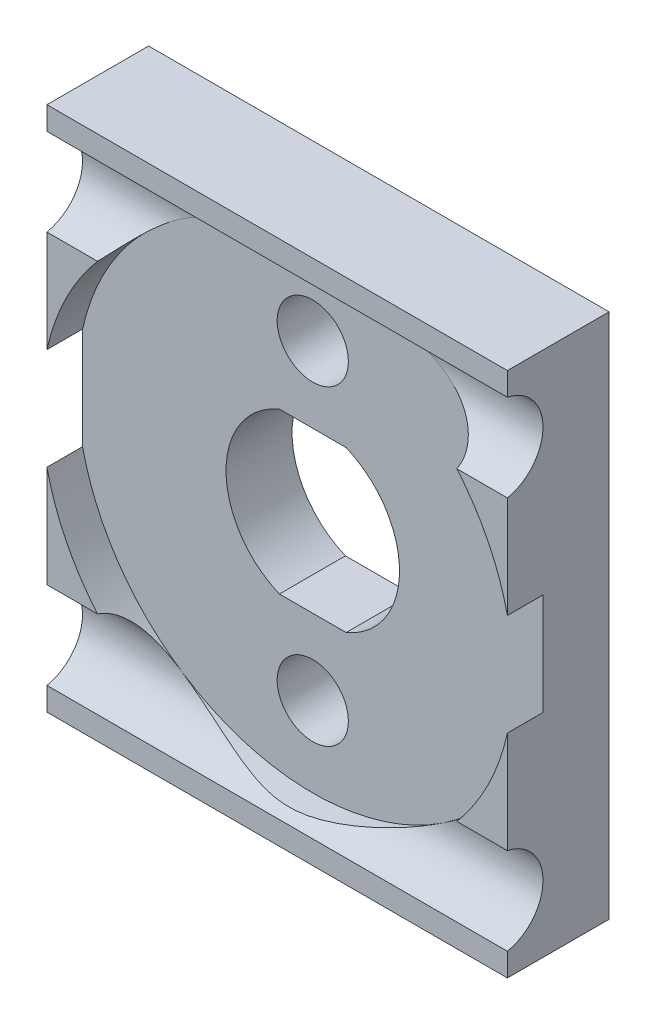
ISO-10303-21;
HEADER;
FILE_DESCRIPTION(('STEP AP214'),'2;1');
FILE_NAME('part.step','',(''),(''),'','','');
FILE_SCHEMA(('AUTOMOTIVE_DESIGN { 1 0 10303 214 1 1 1 1 }'));
ENDSEC;
DATA;
#1=APPLICATION_CONTEXT('core data for automotive mechanical design processes');
#2=APPLICATION_PROTOCOL_DEFINITION('international standard','automotive_design',2000,#1);
#3=PRODUCT_CONTEXT('',#1,'mechanical');
#4=PRODUCT('Part','Part','',(#3));
#5=PRODUCT_RELATED_PRODUCT_CATEGORY('part','',(#4));
#6=PRODUCT_DEFINITION_FORMATION('','',#4);
#7=PRODUCT_DEFINITION_CONTEXT('part definition',#1,'design');
#8=PRODUCT_DEFINITION('design','',#6,#7);
#9=PRODUCT_DEFINITION_SHAPE('','',#8);
#10=(LENGTH_UNIT() NAMED_UNIT(*) SI_UNIT(.MILLI.,.METRE.));
#11=(NAMED_UNIT(*) PLANE_ANGLE_UNIT() SI_UNIT($,.RADIAN.));
#12=(NAMED_UNIT(*) SI_UNIT($,.STERADIAN.) SOLID_ANGLE_UNIT());
#13=UNCERTAINTY_MEASURE_WITH_UNIT(LENGTH_MEASURE(1.E-05),#10,'distance_accuracy_value','');
#14=(GEOMETRIC_REPRESENTATION_CONTEXT(3) GLOBAL_UNCERTAINTY_ASSIGNED_CONTEXT((#13)) GLOBAL_UNIT_ASSIGNED_CONTEXT((#10,
#11,#12)) REPRESENTATION_CONTEXT('',''));
#15=CARTESIAN_POINT('',(0.,0.,0.));
#16=DIRECTION('',(0.,0.,1.));
#17=DIRECTION('',(1.,0.,0.));
#18=AXIS2_PLACEMENT_3D('',#15,#16,#17);
#19=CARTESIAN_POINT('',(-20.7,0.,4.57));
#20=DIRECTION('',(0.,0.,1.));
#21=DIRECTION('',(1.,0.,0.));
#22=AXIS2_PLACEMENT_3D('',#19,#20,#21);
#23=PLANE('',#22);
#24=DIRECTION('',(1.,0.,0.));
#25=VECTOR('',#24,1.);
#26=CARTESIAN_POINT('',(-20.7,18.6904082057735,4.57));
#27=LINE('',#26,#25);
#28=CARTESIAN_POINT('',(-20.7,18.6904082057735,4.57));
#29=VERTEX_POINT('',#28);
#30=CARTESIAN_POINT('',(-18.4262720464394,18.6904082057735,4.57));
#31=VERTEX_POINT('',#30);
#32=EDGE_CURVE('E46',#29,#31,#27,.T.);
#33=ORIENTED_EDGE('',*,*,#32,.F.);
#34=DIRECTION('',(0.,-1.,0.));
#35=VECTOR('',#34,1.);
#36=CARTESIAN_POINT('',(-20.7,23.65,4.57));
#37=LINE('',#36,#35);
#38=CARTESIAN_POINT('',(-20.7,14.1135584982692,4.57));
#39=VERTEX_POINT('',#38);
#40=EDGE_CURVE('E179',#29,#39,#37,.T.);
#41=ORIENTED_EDGE('',*,*,#40,.T.);
#42=CARTESIAN_POINT('',(-10.35,11.825,4.57));
#43=DIRECTION('',(0.,0.,1.));
#44=DIRECTION('',(1.,0.,0.));
#45=AXIS2_PLACEMENT_3D('',#42,#43,#44);
#46=CIRCLE('',#45,10.6);
#47=EDGE_CURVE('E181',#31,#39,#46,.T.);
#48=ORIENTED_EDGE('',*,*,#47,.F.);
#49=EDGE_LOOP('',(#33,#41,#48));
#50=FACE_BOUND('',#49,.T.);
#51=ADVANCED_FACE('F31',(#50),#23,.T.);
#52=CARTESIAN_POINT('',(-2.27372795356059,18.6904082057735,4.57));
#53=VERTEX_POINT('',#52);
#54=CARTESIAN_POINT('',(0.,18.6904082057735,4.57));
#55=VERTEX_POINT('',#54);
#56=EDGE_CURVE('E185',#53,#55,#27,.T.);
#57=ORIENTED_EDGE('',*,*,#56,.F.);
#58=CARTESIAN_POINT('',(0.,14.1135584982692,4.57));
#59=VERTEX_POINT('',#58);
#60=EDGE_CURVE('E284',#59,#53,#46,.T.);
#61=ORIENTED_EDGE('',*,*,#60,.F.);
#62=DIRECTION('',(0.,1.,0.));
#63=VECTOR('',#62,1.);
#64=CARTESIAN_POINT('',(0.,23.65,4.57));
#65=LINE('',#64,#63);
#66=EDGE_CURVE('E380',#59,#55,#65,.T.);
#67=ORIENTED_EDGE('',*,*,#66,.T.);
#68=EDGE_LOOP('',(#57,#61,#67));
#69=FACE_BOUND('',#68,.T.);
#70=ADVANCED_FACE('F323',(#69),#23,.T.);
#71=CARTESIAN_POINT('',(-10.35,11.825,2.97));
#72=DIRECTION('',(0.,0.,1.));
#73=DIRECTION('',(1.,0.,0.));
#74=AXIS2_PLACEMENT_3D('',#71,#72,#73);
#75=CYLINDRICAL_SURFACE('',#74,10.6);
#76=ORIENTED_EDGE('',*,*,#60,.T.);
#77=CARTESIAN_POINT('',(-2.27372795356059,18.6904082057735,4.57));
#78=CARTESIAN_POINT('',(-2.28220702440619,18.700379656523,4.5210976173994));
#79=CARTESIAN_POINT('',(-2.29223782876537,18.7121453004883,4.4728485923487));
#80=CARTESIAN_POINT('',(-2.31524815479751,18.7389775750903,4.37804860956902));
#81=CARTESIAN_POINT('',(-2.32822490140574,18.7540410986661,4.33149610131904));
#82=CARTESIAN_POINT('',(-2.35687266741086,18.7870675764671,4.24075534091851));
#83=CARTESIAN_POINT('',(-2.37252108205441,18.805006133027,4.19655103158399));
#84=CARTESIAN_POINT('',(-2.40641220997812,18.8435521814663,4.11036182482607));
#85=CARTESIAN_POINT('',(-2.4246554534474,18.864160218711,4.06837738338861));
#86=CARTESIAN_POINT('',(-2.48287698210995,18.9293467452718,3.94637174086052));
#87=CARTESIAN_POINT('',(-2.52647651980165,18.9774390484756,3.86989396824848));
#88=CARTESIAN_POINT('',(-2.62191541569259,19.0804576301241,3.72729442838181));
#89=CARTESIAN_POINT('',(-2.67377295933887,19.1353989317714,3.66119617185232));
#90=CARTESIAN_POINT('',(-2.80915188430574,19.2754220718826,3.51221071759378));
#91=CARTESIAN_POINT('',(-2.89644963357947,19.3629786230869,3.43507116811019));
#92=CARTESIAN_POINT('',(-3.08193633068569,19.5419904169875,3.30120804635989));
#93=CARTESIAN_POINT('',(-3.18014325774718,19.6334519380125,3.24451885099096));
#94=CARTESIAN_POINT('',(-3.35744848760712,19.7920827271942,3.1617667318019));
#95=CARTESIAN_POINT('',(-3.43468679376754,19.8592465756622,3.13156840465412));
#96=CARTESIAN_POINT('',(-3.5927757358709,19.9926582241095,3.07975618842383));
#97=CARTESIAN_POINT('',(-3.67362806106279,20.0589055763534,3.05814636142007));
#98=CARTESIAN_POINT('',(-3.92081362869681,20.2552858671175,3.00463333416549));
#99=CARTESIAN_POINT('',(-4.09163864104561,20.3829339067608,2.98410564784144));
#100=CARTESIAN_POINT('',(-4.40929989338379,20.6055876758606,2.96797648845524));
#101=CARTESIAN_POINT('',(-4.55483064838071,20.7023013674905,2.96851245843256));
#102=CARTESIAN_POINT('',(-4.85015823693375,20.8882316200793,2.98205267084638));
#103=CARTESIAN_POINT('',(-4.99995787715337,20.9774430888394,2.99506530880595));
#104=CARTESIAN_POINT('',(-5.30320420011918,21.1481018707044,3.03105227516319));
#105=CARTESIAN_POINT('',(-5.45665932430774,21.2295284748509,3.05405231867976));
#106=CARTESIAN_POINT('',(-5.76628708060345,21.3842647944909,3.10785990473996));
#107=CARTESIAN_POINT('',(-5.92246061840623,21.4575717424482,3.13867009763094));
#108=CARTESIAN_POINT('',(-6.35068554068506,21.6460535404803,3.23061263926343));
#109=CARTESIAN_POINT('',(-6.6250274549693,21.7532651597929,3.29758156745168));
#110=CARTESIAN_POINT('',(-7.04094692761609,21.8963315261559,3.40468364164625));
#111=CARTESIAN_POINT('',(-7.18044391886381,21.9410928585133,3.44152724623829));
#112=CARTESIAN_POINT('',(-7.46090308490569,22.0247316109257,3.5162957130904));
#113=CARTESIAN_POINT('',(-7.60186507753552,22.0636097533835,3.55422044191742));
#114=CARTESIAN_POINT('',(-7.88435376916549,22.1352706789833,3.62960605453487));
#115=CARTESIAN_POINT('',(-8.0258700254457,22.1680933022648,3.66706833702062));
#116=CARTESIAN_POINT('',(-8.31058738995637,22.2279785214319,3.74027707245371));
#117=CARTESIAN_POINT('',(-8.45378874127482,22.2550402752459,3.77602327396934));
#118=CARTESIAN_POINT('',(-8.74180501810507,22.3033106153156,3.84381520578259));
#119=CARTESIAN_POINT('',(-8.88661687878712,22.3245288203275,3.87586696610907));
#120=CARTESIAN_POINT('',(-9.17815744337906,22.361050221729,3.93390897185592));
#121=CARTESIAN_POINT('',(-9.32488528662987,22.3763559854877,3.95990184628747));
#122=CARTESIAN_POINT('',(-9.62948314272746,22.4016551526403,4.00438499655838));
#123=CARTESIAN_POINT('',(-9.78747421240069,22.4112545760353,4.0223015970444));
#124=CARTESIAN_POINT('',(-10.1046153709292,22.4233455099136,4.04510602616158));
#125=CARTESIAN_POINT('',(-10.2637645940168,22.4258418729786,4.05000274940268));
#126=CARTESIAN_POINT('',(-10.5819111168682,22.4236576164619,4.04580274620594));
#127=CARTESIAN_POINT('',(-10.7409082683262,22.4189726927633,4.03669762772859));
#128=CARTESIAN_POINT('',(-11.0574185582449,22.4025572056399,4.00624487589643));
#129=CARTESIAN_POINT('',(-11.2149303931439,22.3908209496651,3.9848873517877));
#130=CARTESIAN_POINT('',(-11.5043068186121,22.3628098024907,3.93707968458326));
#131=CARTESIAN_POINT('',(-11.6364789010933,22.3474781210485,3.91187162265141));
#132=CARTESIAN_POINT('',(-11.8992616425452,22.3120096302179,3.85698995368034));
#133=CARTESIAN_POINT('',(-12.0298718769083,22.291871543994,3.82731516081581));
#134=CARTESIAN_POINT('',(-12.2897079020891,22.246848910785,3.76519898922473));
#135=CARTESIAN_POINT('',(-12.4189325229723,22.2219606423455,3.73275545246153));
#136=CARTESIAN_POINT('',(-12.6760367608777,22.1674763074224,3.6665006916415));
#137=CARTESIAN_POINT('',(-12.803916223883,22.1378797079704,3.63268931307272));
#138=CARTESIAN_POINT('',(-13.1867016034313,22.0417792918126,3.53066883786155));
#139=CARTESIAN_POINT('',(-13.4397633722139,21.9681368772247,3.46212925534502));
#140=CARTESIAN_POINT('',(-13.9409912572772,21.8016920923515,3.33145297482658));
#141=CARTESIAN_POINT('',(-14.189161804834,21.7089080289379,3.26931024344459));
#142=CARTESIAN_POINT('',(-14.5764438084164,21.5471792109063,3.18125433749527));
#143=CARTESIAN_POINT('',(-14.7173241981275,21.4847295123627,3.15112842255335));
#144=CARTESIAN_POINT('',(-14.9970844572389,21.3532989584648,3.09638347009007));
#145=CARTESIAN_POINT('',(-15.1359647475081,21.2843195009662,3.07176325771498));
#146=CARTESIAN_POINT('',(-15.4112727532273,21.1399158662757,3.02947459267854));
#147=CARTESIAN_POINT('',(-15.5477025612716,21.0644975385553,3.01179991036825));
#148=CARTESIAN_POINT('',(-15.8177185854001,20.9073143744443,2.98502005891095));
#149=CARTESIAN_POINT('',(-15.9513056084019,20.8255513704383,2.97591242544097));
#150=CARTESIAN_POINT('',(-16.1814691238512,20.6775503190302,2.96918882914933));
#151=CARTESIAN_POINT('',(-16.2788316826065,20.6126406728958,2.96924243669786));
#152=CARTESIAN_POINT('',(-16.4711820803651,20.4797550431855,2.9761486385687));
#153=CARTESIAN_POINT('',(-16.5661705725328,20.4117799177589,2.98299934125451));
#154=CARTESIAN_POINT('',(-16.7531579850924,20.2732588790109,3.00455550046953));
#155=CARTESIAN_POINT('',(-16.8451611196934,20.2027169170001,3.01924932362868));
#156=CARTESIAN_POINT('',(-17.0256173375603,20.059645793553,3.05768080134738));
#157=CARTESIAN_POINT('',(-17.114072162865,19.9871176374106,3.08141395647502));
#158=CARTESIAN_POINT('',(-17.3120303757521,19.8194657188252,3.14775797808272));
#159=CARTESIAN_POINT('',(-17.4200873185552,19.7239607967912,3.19386574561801));
#160=CARTESIAN_POINT('',(-17.6264181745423,19.5342992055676,3.30646888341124));
#161=CARTESIAN_POINT('',(-17.7247035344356,19.4401410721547,3.37294001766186));
#162=CARTESIAN_POINT('',(-17.8881493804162,19.2779570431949,3.51182419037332));
#163=CARTESIAN_POINT('',(-17.9558595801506,19.2087100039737,3.57978078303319));
#164=CARTESIAN_POINT('',(-18.0812427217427,19.0773172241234,3.73039637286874));
#165=CARTESIAN_POINT('',(-18.1389241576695,19.0151654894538,3.81304280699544));
#166=CARTESIAN_POINT('',(-18.2326130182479,18.9121977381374,3.97621698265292));
#167=CARTESIAN_POINT('',(-18.2706536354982,18.8695559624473,4.0544241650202));
#168=CARTESIAN_POINT('',(-18.3371230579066,18.7941031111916,4.21913505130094));
#169=CARTESIAN_POINT('',(-18.3655753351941,18.761268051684,4.30561781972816));
#170=CARTESIAN_POINT('',(-18.3960440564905,18.7258188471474,4.42371723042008));
#171=CARTESIAN_POINT('',(-18.4028704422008,18.7178492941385,4.45260158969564));
#172=CARTESIAN_POINT('',(-18.4154094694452,18.703172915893,4.51090913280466));
#173=CARTESIAN_POINT('',(-18.4211227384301,18.6964653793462,4.5403320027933));
#174=CARTESIAN_POINT('',(-18.4262720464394,18.6904082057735,4.57));
#175=B_SPLINE_CURVE_WITH_KNOTS('',3,(#77,#78,#79,#80,#81,#82,#83,#84,#85,#86,#87,#88,#89,#90,
#91,#92,#93,#94,#95,#96,#97,#98,#99,#100,#101,#102,#103,#104,#105,#106,#107,#108,#109,#110,#111,
#112,#113,#114,#115,#116,#117,#118,#119,#120,#121,#122,#123,#124,#125,#126,#127,#128,#129,#130,
#131,#132,#133,#134,#135,#136,#137,#138,#139,#140,#141,#142,#143,#144,#145,#146,#147,#148,#149,
#150,#151,#152,#153,#154,#155,#156,#157,#158,#159,#160,#161,#162,#163,#164,#165,#166,#167,#168,
#169,#170,#171,#172,#173,#174),.UNSPECIFIED.,.F.,.F.,(4,2,2,2,2,2,2,2,2,2,2,2,2,2,2,2,2,2,2,2,2,
2,2,2,2,2,2,2,2,2,2,2,2,2,2,2,2,2,2,2,2,2,2,2,2,2,2,2,4),(0.,0.151785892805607,0.3034293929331,
0.453848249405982,0.604297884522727,0.903862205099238,1.20409557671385,1.6388540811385,
2.07434004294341,2.39406350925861,2.71393801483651,3.35426011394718,3.87782539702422,
4.4017432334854,4.92701810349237,5.45247146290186,6.35712237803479,6.81023339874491,
7.2632887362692,7.71324787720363,8.16327274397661,8.61255235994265,9.06163666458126,
9.53892348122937,10.0158841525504,10.493130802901,10.9707632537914,11.3768487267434,
11.7830421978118,12.1895552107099,12.5961142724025,13.4123389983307,14.2277866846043,
14.6986385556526,15.1693898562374,15.6397179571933,16.1099107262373,16.4607338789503,
16.8114594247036,17.1616661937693,17.5116988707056,17.9645171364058,18.4167985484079,
18.7704549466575,19.1238103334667,19.4132533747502,19.7019826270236,19.7941387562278,
19.8862427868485),.UNSPECIFIED.);
#176=CARTESIAN_POINT('',(-4.47808591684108,20.65,2.97));
#177=VERTEX_POINT('',#176);
#178=EDGE_CURVE('E182',#53,#177,#175,.T.);
#179=ORIENTED_EDGE('',*,*,#178,.T.);
#180=CARTESIAN_POINT('',(-10.35,11.825,2.97));
#181=DIRECTION('',(0.,0.,1.));
#182=DIRECTION('',(1.,0.,0.));
#183=AXIS2_PLACEMENT_3D('',#180,#181,#182);
#184=CIRCLE('',#183,10.6);
#185=CARTESIAN_POINT('',(0.,14.1135584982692,2.97));
#186=VERTEX_POINT('',#185);
#187=EDGE_CURVE('E258',#186,#177,#184,.T.);
#188=ORIENTED_EDGE('',*,*,#187,.F.);
#189=DIRECTION('',(0.,0.,1.));
#190=VECTOR('',#189,1.);
#191=CARTESIAN_POINT('',(0.,14.1135584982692,2.97));
#192=LINE('',#191,#190);
#193=EDGE_CURVE('E247',#186,#59,#192,.T.);
#194=ORIENTED_EDGE('',*,*,#193,.T.);
#195=EDGE_LOOP('',(#76,#179,#188,#194));
#196=FACE_BOUND('',#195,.T.);
#197=ADVANCED_FACE('F329',(#196),#75,.F.);
#198=CARTESIAN_POINT('',(-16.2219140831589,20.65,2.97));
#199=VERTEX_POINT('',#198);
#200=EDGE_CURVE('E261',#177,#199,#184,.T.);
#201=ORIENTED_EDGE('',*,*,#200,.F.);
#202=EDGE_CURVE('E183',#177,#199,#175,.T.);
#203=ORIENTED_EDGE('',*,*,#202,.T.);
#204=EDGE_LOOP('',(#201,#203));
#205=FACE_BOUND('',#204,.T.);
#206=ADVANCED_FACE('F366',(#205),#75,.F.);
#207=DIRECTION('',(1.,0.,0.));
#208=VECTOR('',#207,1.);
#209=CARTESIAN_POINT('',(-20.7,1.04040820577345,4.57));
#210=LINE('',#209,#208);
#211=CARTESIAN_POINT('',(-20.7,1.04040820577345,4.57));
#212=VERTEX_POINT('',#211);
#213=CARTESIAN_POINT('',(0.,1.04040820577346,4.57));
#214=VERTEX_POINT('',#213);
#215=EDGE_CURVE('E288',#212,#214,#210,.T.);
#216=ORIENTED_EDGE('',*,*,#215,.F.);
#217=CARTESIAN_POINT('',(-20.7,0.,4.57));
#218=VERTEX_POINT('',#217);
#219=EDGE_CURVE('E193',#212,#218,#37,.T.);
#220=ORIENTED_EDGE('',*,*,#219,.T.);
#221=DIRECTION('',(1.,0.,0.));
#222=VECTOR('',#221,1.);
#223=CARTESIAN_POINT('',(-20.7,0.,4.57));
#224=LINE('',#223,#222);
#225=CARTESIAN_POINT('',(0.,0.,4.57));
#226=VERTEX_POINT('',#225);
#227=EDGE_CURVE('E194',#218,#226,#224,.T.);
#228=ORIENTED_EDGE('',*,*,#227,.T.);
#229=EDGE_CURVE('E379',#226,#214,#65,.T.);
#230=ORIENTED_EDGE('',*,*,#229,.T.);
#231=EDGE_LOOP('',(#216,#220,#228,#230));
#232=FACE_BOUND('',#231,.T.);
#233=ADVANCED_FACE('F331',(#232),#23,.T.);
#234=DIRECTION('',(1.,0.,0.));
#235=VECTOR('',#234,1.);
#236=CARTESIAN_POINT('',(-20.7,4.95959179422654,4.57));
#237=LINE('',#236,#235);
#238=CARTESIAN_POINT('',(0.,4.95959179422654,4.57));
#239=VERTEX_POINT('',#238);
#240=CARTESIAN_POINT('',(-2.27372795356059,4.95959179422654,4.57));
#241=VERTEX_POINT('',#240);
#242=EDGE_CURVE('E54',#239,#241,#237,.F.);
#243=ORIENTED_EDGE('',*,*,#242,.F.);
#244=CARTESIAN_POINT('',(0.,9.53644150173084,4.57));
#245=VERTEX_POINT('',#244);
#246=EDGE_CURVE('E369',#239,#245,#65,.T.);
#247=ORIENTED_EDGE('',*,*,#246,.T.);
#248=EDGE_CURVE('E287',#241,#245,#46,.T.);
#249=ORIENTED_EDGE('',*,*,#248,.F.);
#250=EDGE_LOOP('',(#243,#247,#249));
#251=FACE_BOUND('',#250,.T.);
#252=ADVANCED_FACE('F348',(#251),#23,.T.);
#253=CARTESIAN_POINT('',(-20.7,9.53644150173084,4.57));
#254=VERTEX_POINT('',#253);
#255=CARTESIAN_POINT('',(-18.4262720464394,4.95959179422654,4.57));
#256=VERTEX_POINT('',#255);
#257=EDGE_CURVE('E283',#254,#256,#46,.T.);
#258=ORIENTED_EDGE('',*,*,#257,.T.);
#259=CARTESIAN_POINT('',(-18.4262720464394,4.95959179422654,4.57));
#260=CARTESIAN_POINT('',(-18.4177929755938,4.94962034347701,4.5210976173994));
#261=CARTESIAN_POINT('',(-18.4077621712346,4.93785469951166,4.4728485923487));
#262=CARTESIAN_POINT('',(-18.3847518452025,4.91102242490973,4.37804860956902));
#263=CARTESIAN_POINT('',(-18.3717750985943,4.89595890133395,4.33149610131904));
#264=CARTESIAN_POINT('',(-18.3431273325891,4.86293242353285,4.24075534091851));
#265=CARTESIAN_POINT('',(-18.3274789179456,4.84499386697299,4.19655103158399));
#266=CARTESIAN_POINT('',(-18.2935877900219,4.80644781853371,4.11036182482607));
#267=CARTESIAN_POINT('',(-18.2753445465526,4.78583978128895,4.06837738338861));
#268=CARTESIAN_POINT('',(-18.21712301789,4.72065325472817,3.94637174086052));
#269=CARTESIAN_POINT('',(-18.1735234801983,4.67256095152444,3.86989396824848));
#270=CARTESIAN_POINT('',(-18.0780845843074,4.5695423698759,3.72729442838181));
#271=CARTESIAN_POINT('',(-18.0262270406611,4.51460106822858,3.66119617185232));
#272=CARTESIAN_POINT('',(-17.8908481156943,4.37457792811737,3.51221071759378));
#273=CARTESIAN_POINT('',(-17.8035503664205,4.28702137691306,3.43507116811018));
#274=CARTESIAN_POINT('',(-17.6180636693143,4.10800958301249,3.30120804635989));
#275=CARTESIAN_POINT('',(-17.5198567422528,4.01654806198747,3.24451885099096));
#276=CARTESIAN_POINT('',(-17.3425515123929,3.85791727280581,3.1617667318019));
#277=CARTESIAN_POINT('',(-17.2653132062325,3.79075342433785,3.13156840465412));
#278=CARTESIAN_POINT('',(-17.1072242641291,3.65734177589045,3.07975618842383));
#279=CARTESIAN_POINT('',(-17.0263719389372,3.59109442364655,3.05814636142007));
#280=CARTESIAN_POINT('',(-16.7791863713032,3.3947141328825,3.00463333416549));
#281=CARTESIAN_POINT('',(-16.6083613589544,3.26706609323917,2.98410564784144));
#282=CARTESIAN_POINT('',(-16.2907001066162,3.04441232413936,2.96797648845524));
#283=CARTESIAN_POINT('',(-16.1451693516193,2.9476986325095,2.96851245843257));
#284=CARTESIAN_POINT('',(-15.8498417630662,2.76176837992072,2.98205267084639));
#285=CARTESIAN_POINT('',(-15.7000421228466,2.67255691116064,2.99506530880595));
#286=CARTESIAN_POINT('',(-15.3967957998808,2.50189812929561,3.03105227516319));
#287=CARTESIAN_POINT('',(-15.2433406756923,2.42047152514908,3.05405231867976));
#288=CARTESIAN_POINT('',(-14.9337129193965,2.26573520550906,3.10785990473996));
#289=CARTESIAN_POINT('',(-14.7775393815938,2.19242825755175,3.13867009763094));
#290=CARTESIAN_POINT('',(-14.3493144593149,2.00394645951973,3.23061263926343));
#291=CARTESIAN_POINT('',(-14.0749725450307,1.8967348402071,3.29758156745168));
#292=CARTESIAN_POINT('',(-13.6590530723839,1.75366847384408,3.40468364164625));
#293=CARTESIAN_POINT('',(-13.5195560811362,1.70890714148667,3.44152724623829));
#294=CARTESIAN_POINT('',(-13.2390969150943,1.62526838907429,3.5162957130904));
#295=CARTESIAN_POINT('',(-13.0981349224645,1.58639024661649,3.55422044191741));
#296=CARTESIAN_POINT('',(-12.8156462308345,1.51472932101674,3.62960605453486));
#297=CARTESIAN_POINT('',(-12.6741299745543,1.48190669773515,3.66706833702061));
#298=CARTESIAN_POINT('',(-12.3894126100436,1.42202147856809,3.74027707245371));
#299=CARTESIAN_POINT('',(-12.2462112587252,1.39495972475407,3.77602327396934));
#300=CARTESIAN_POINT('',(-11.9581949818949,1.34668938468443,3.84381520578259));
#301=CARTESIAN_POINT('',(-11.8133831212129,1.32547117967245,3.87586696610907));
#302=CARTESIAN_POINT('',(-11.5218425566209,1.28894977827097,3.93390897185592));
#303=CARTESIAN_POINT('',(-11.3751147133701,1.27364401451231,3.95990184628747));
#304=CARTESIAN_POINT('',(-11.0705168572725,1.24834484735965,4.00438499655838));
#305=CARTESIAN_POINT('',(-10.9125257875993,1.23874542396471,4.0223015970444));
#306=CARTESIAN_POINT('',(-10.5953846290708,1.22665449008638,4.04510602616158));
#307=CARTESIAN_POINT('',(-10.4362354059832,1.22415812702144,4.05000274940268));
#308=CARTESIAN_POINT('',(-10.1180888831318,1.22634238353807,4.04580274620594));
#309=CARTESIAN_POINT('',(-9.95909173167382,1.23102730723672,4.03669762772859));
#310=CARTESIAN_POINT('',(-9.64258144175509,1.24744279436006,4.00624487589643));
#311=CARTESIAN_POINT('',(-9.48506960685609,1.25917905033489,3.9848873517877));
#312=CARTESIAN_POINT('',(-9.1956931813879,1.28719019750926,3.93707968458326));
#313=CARTESIAN_POINT('',(-9.06352109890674,1.30252187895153,3.9118716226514));
#314=CARTESIAN_POINT('',(-8.80073835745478,1.33799036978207,3.85698995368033));
#315=CARTESIAN_POINT('',(-8.67012812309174,1.35812845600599,3.8273151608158));
#316=CARTESIAN_POINT('',(-8.41029209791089,1.40315108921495,3.76519898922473));
#317=CARTESIAN_POINT('',(-8.28106747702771,1.42803935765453,3.73275545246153));
#318=CARTESIAN_POINT('',(-8.02396323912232,1.48252369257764,3.6665006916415));
#319=CARTESIAN_POINT('',(-7.89608377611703,1.51212029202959,3.63268931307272));
#320=CARTESIAN_POINT('',(-7.51329839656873,1.60822070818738,3.53066883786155));
#321=CARTESIAN_POINT('',(-7.26023662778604,1.68186312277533,3.46212925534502));
#322=CARTESIAN_POINT('',(-6.75900874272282,1.8483079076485,3.33145297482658));
#323=CARTESIAN_POINT('',(-6.51083819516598,1.94109197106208,3.26931024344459));
#324=CARTESIAN_POINT('',(-6.12355619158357,2.10282078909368,3.18125433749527));
#325=CARTESIAN_POINT('',(-5.98267580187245,2.16527048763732,3.15112842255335));
#326=CARTESIAN_POINT('',(-5.70291554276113,2.29670104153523,3.09638347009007));
#327=CARTESIAN_POINT('',(-5.56403525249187,2.36568049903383,3.07176325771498));
#328=CARTESIAN_POINT('',(-5.28872724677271,2.5100841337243,3.02947459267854));
#329=CARTESIAN_POINT('',(-5.15229743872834,2.5855024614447,3.01179991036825));
#330=CARTESIAN_POINT('',(-4.88228141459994,2.7426856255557,2.98502005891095));
#331=CARTESIAN_POINT('',(-4.74869439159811,2.8244486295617,2.97591242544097));
#332=CARTESIAN_POINT('',(-4.51853087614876,2.97244968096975,2.96918882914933));
#333=CARTESIAN_POINT('',(-4.4211683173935,3.03735932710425,2.96924243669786));
#334=CARTESIAN_POINT('',(-4.22881791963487,3.17024495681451,2.9761486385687));
#335=CARTESIAN_POINT('',(-4.13382942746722,3.23822008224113,2.98299934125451));
#336=CARTESIAN_POINT('',(-3.94684201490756,3.37674112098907,3.00455550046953));
#337=CARTESIAN_POINT('',(-3.85483888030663,3.44728308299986,3.01924932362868));
#338=CARTESIAN_POINT('',(-3.67438266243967,3.59035420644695,3.05768080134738));
#339=CARTESIAN_POINT('',(-3.58592783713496,3.66288236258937,3.08141395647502));
#340=CARTESIAN_POINT('',(-3.3879696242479,3.83053428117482,3.14775797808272));
#341=CARTESIAN_POINT('',(-3.27991268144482,3.92603920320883,3.19386574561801));
#342=CARTESIAN_POINT('',(-3.0735818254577,4.11570079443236,3.30646888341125));
#343=CARTESIAN_POINT('',(-2.97529646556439,4.20985892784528,3.37294001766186));
#344=CARTESIAN_POINT('',(-2.81185061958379,4.37204295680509,3.51182419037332));
#345=CARTESIAN_POINT('',(-2.74414041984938,4.44128999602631,3.57978078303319));
#346=CARTESIAN_POINT('',(-2.61875727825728,4.57268277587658,3.73039637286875));
#347=CARTESIAN_POINT('',(-2.56107584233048,4.63483451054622,3.81304280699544));
#348=CARTESIAN_POINT('',(-2.46738698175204,4.73780226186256,3.97621698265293));
#349=CARTESIAN_POINT('',(-2.42934636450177,4.78044403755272,4.05442416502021));
#350=CARTESIAN_POINT('',(-2.36287694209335,4.85589688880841,4.21913505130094));
#351=CARTESIAN_POINT('',(-2.33442466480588,4.88873194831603,4.30561781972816));
#352=CARTESIAN_POINT('',(-2.3039559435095,4.92418115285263,4.42371723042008));
#353=CARTESIAN_POINT('',(-2.29712955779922,4.93215070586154,4.45260158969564));
#354=CARTESIAN_POINT('',(-2.28459053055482,4.946827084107,4.51090913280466));
#355=CARTESIAN_POINT('',(-2.2788772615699,4.95353462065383,4.5403320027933));
#356=CARTESIAN_POINT('',(-2.2737279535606,4.95959179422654,4.57));
#357=B_SPLINE_CURVE_WITH_KNOTS('',3,(#259,#260,#261,#262,#263,#264,#265,#266,#267,#268,#269,
#270,#271,#272,#273,#274,#275,#276,#277,#278,#279,#280,#281,#282,#283,#284,#285,#286,#287,#288,
#289,#290,#291,#292,#293,#294,#295,#296,#297,#298,#299,#300,#301,#302,#303,#304,#305,#306,#307,
#308,#309,#310,#311,#312,#313,#314,#315,#316,#317,#318,#319,#320,#321,#322,#323,#324,#325,#326,
#327,#328,#329,#330,#331,#332,#333,#334,#335,#336,#337,#338,#339,#340,#341,#342,#343,#344,#345,
#346,#347,#348,#349,#350,#351,#352,#353,#354,#355,#356),.UNSPECIFIED.,.F.,.F.,(4,2,2,2,2,2,2,2,
2,2,2,2,2,2,2,2,2,2,2,2,2,2,2,2,2,2,2,2,2,2,2,2,2,2,2,2,2,2,2,2,2,2,2,2,2,2,2,2,4),(0.,
0.151785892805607,0.303429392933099,0.453848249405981,0.604297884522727,0.90386220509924,
1.20409557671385,1.6388540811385,2.07434004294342,2.39406350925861,2.71393801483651,
3.35426011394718,3.87782539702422,4.4017432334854,4.92701810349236,5.45247146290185,
6.35712237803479,6.81023339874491,7.2632887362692,7.71324787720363,8.16327274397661,
8.61255235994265,9.06163666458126,9.53892348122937,10.0158841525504,10.493130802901,
10.9707632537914,11.3768487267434,11.7830421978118,12.1895552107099,12.5961142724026,
13.4123389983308,14.2277866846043,14.6986385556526,15.1693898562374,15.6397179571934,
16.1099107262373,16.4607338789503,16.8114594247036,17.1616661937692,17.5116988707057,
17.9645171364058,18.4167985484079,18.7704549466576,19.1238103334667,19.4132533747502,
19.7019826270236,19.7941387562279,19.8862427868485),.UNSPECIFIED.);
#358=CARTESIAN_POINT('',(-16.2219140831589,3.,2.97));
#359=VERTEX_POINT('',#358);
#360=EDGE_CURVE('E292',#256,#359,#357,.T.);
#361=ORIENTED_EDGE('',*,*,#360,.T.);
#362=CARTESIAN_POINT('',(-20.7,9.53644150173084,2.97));
#363=VERTEX_POINT('',#362);
#364=EDGE_CURVE('E249',#363,#359,#184,.T.);
#365=ORIENTED_EDGE('',*,*,#364,.F.);
#366=DIRECTION('',(0.,0.,1.));
#367=VECTOR('',#366,1.);
#368=CARTESIAN_POINT('',(-20.7,9.53644150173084,2.97));
#369=LINE('',#368,#367);
#370=EDGE_CURVE('E251',#363,#254,#369,.T.);
#371=ORIENTED_EDGE('',*,*,#370,.T.);
#372=EDGE_LOOP('',(#258,#361,#365,#371));
#373=FACE_BOUND('',#372,.T.);
#374=ADVANCED_FACE('F356',(#373),#75,.F.);
#375=CARTESIAN_POINT('',(-4.47808591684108,3.,2.97));
#376=VERTEX_POINT('',#375);
#377=EDGE_CURVE('E428',#359,#376,#184,.T.);
#378=ORIENTED_EDGE('',*,*,#377,.F.);
#379=EDGE_CURVE('E293',#359,#376,#357,.T.);
#380=ORIENTED_EDGE('',*,*,#379,.T.);
#381=EDGE_LOOP('',(#378,#380));
#382=FACE_BOUND('',#381,.T.);
#383=ADVANCED_FACE('F320',(#382),#75,.F.);
#384=CARTESIAN_POINT('',(-20.7,4.95959179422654,4.57));
#385=VERTEX_POINT('',#384);
#386=EDGE_CURVE('E290',#256,#385,#237,.F.);
#387=ORIENTED_EDGE('',*,*,#386,.F.);
#388=ORIENTED_EDGE('',*,*,#257,.F.);
#389=EDGE_CURVE('E191',#254,#385,#37,.T.);
#390=ORIENTED_EDGE('',*,*,#389,.T.);
#391=EDGE_LOOP('',(#387,#388,#390));
#392=FACE_BOUND('',#391,.T.);
#393=ADVANCED_FACE('F338',(#392),#23,.T.);
#394=CARTESIAN_POINT('',(-10.35,8.225,0.));
#395=DIRECTION('',(0.,-1.,0.));
#396=DIRECTION('',(0.,0.,-1.));
#397=AXIS2_PLACEMENT_3D('',#394,#395,#396);
#398=PLANE('',#397);
#399=DIRECTION('',(1.,0.,0.));
#400=VECTOR('',#399,1.);
#401=CARTESIAN_POINT('',(-10.35,8.225,2.97));
#402=LINE('',#401,#400);
#403=CARTESIAN_POINT('',(-11.85,8.225,2.97));
#404=VERTEX_POINT('',#403);
#405=CARTESIAN_POINT('',(-8.85,8.225,2.97));
#406=VERTEX_POINT('',#405);
#407=EDGE_CURVE('E274',#404,#406,#402,.T.);
#408=ORIENTED_EDGE('',*,*,#407,.T.);
#409=DIRECTION('',(0.,0.,1.));
#410=VECTOR('',#409,1.);
#411=CARTESIAN_POINT('',(-8.85,8.225,0.));
#412=LINE('',#411,#410);
#413=CARTESIAN_POINT('',(-8.85,8.225,0.));
#414=VERTEX_POINT('',#413);
#415=EDGE_CURVE('E217',#414,#406,#412,.T.);
#416=ORIENTED_EDGE('',*,*,#415,.F.);
#417=DIRECTION('',(1.,0.,0.));
#418=VECTOR('',#417,1.);
#419=CARTESIAN_POINT('',(-10.35,8.225,0.));
#420=LINE('',#419,#418);
#421=CARTESIAN_POINT('',(-11.85,8.225,0.));
#422=VERTEX_POINT('',#421);
#423=EDGE_CURVE('E237',#422,#414,#420,.T.);
#424=ORIENTED_EDGE('',*,*,#423,.F.);
#425=DIRECTION('',(0.,0.,1.));
#426=VECTOR('',#425,1.);
#427=CARTESIAN_POINT('',(-11.85,8.225,0.));
#428=LINE('',#427,#426);
#429=EDGE_CURVE('E216',#422,#404,#428,.T.);
#430=ORIENTED_EDGE('',*,*,#429,.T.);
#431=EDGE_LOOP('',(#408,#416,#424,#430));
#432=FACE_BOUND('',#431,.T.);
#433=ADVANCED_FACE('F346',(#432),#398,.F.);
#434=CARTESIAN_POINT('',(-10.35,11.825,0.));
#435=DIRECTION('',(0.,0.,1.));
#436=DIRECTION('',(1.,0.,0.));
#437=AXIS2_PLACEMENT_3D('',#434,#435,#436);
#438=CYLINDRICAL_SURFACE('',#437,3.9);
#439=CARTESIAN_POINT('',(-10.35,11.825,2.97));
#440=DIRECTION('',(0.,0.,1.));
#441=DIRECTION('',(1.,0.,0.));
#442=AXIS2_PLACEMENT_3D('',#439,#440,#441);
#443=CIRCLE('',#442,3.9);
#444=CARTESIAN_POINT('',(-11.85,15.425,2.97));
#445=VERTEX_POINT('',#444);
#446=EDGE_CURVE('E271',#445,#404,#443,.T.);
#447=ORIENTED_EDGE('',*,*,#446,.T.);
#448=ORIENTED_EDGE('',*,*,#429,.F.);
#449=CARTESIAN_POINT('',(-10.35,11.825,0.));
#450=DIRECTION('',(0.,0.,1.));
#451=DIRECTION('',(1.,0.,0.));
#452=AXIS2_PLACEMENT_3D('',#449,#450,#451);
#453=CIRCLE('',#452,3.9);
#454=CARTESIAN_POINT('',(-11.85,15.425,0.));
#455=VERTEX_POINT('',#454);
#456=EDGE_CURVE('E221',#455,#422,#453,.T.);
#457=ORIENTED_EDGE('',*,*,#456,.F.);
#458=DIRECTION('',(0.,0.,1.));
#459=VECTOR('',#458,1.);
#460=CARTESIAN_POINT('',(-11.85,15.425,0.));
#461=LINE('',#460,#459);
#462=EDGE_CURVE('E224',#455,#445,#461,.T.);
#463=ORIENTED_EDGE('',*,*,#462,.T.);
#464=EDGE_LOOP('',(#447,#448,#457,#463));
#465=FACE_BOUND('',#464,.T.);
#466=ADVANCED_FACE('F353',(#465),#438,.F.);
#467=CARTESIAN_POINT('',(-10.35,15.425,0.));
#468=DIRECTION('',(0.,-1.,0.));
#469=DIRECTION('',(0.,0.,-1.));
#470=AXIS2_PLACEMENT_3D('',#467,#468,#469);
#471=PLANE('',#470);
#472=DIRECTION('',(0.,0.,1.));
#473=VECTOR('',#472,1.);
#474=CARTESIAN_POINT('',(-8.85,15.425,0.));
#475=LINE('',#474,#473);
#476=CARTESIAN_POINT('',(-8.85,15.425,0.));
#477=VERTEX_POINT('',#476);
#478=CARTESIAN_POINT('',(-8.85,15.425,2.97));
#479=VERTEX_POINT('',#478);
#480=EDGE_CURVE('E220',#477,#479,#475,.T.);
#481=ORIENTED_EDGE('',*,*,#480,.T.);
#482=DIRECTION('',(1.,0.,0.));
#483=VECTOR('',#482,1.);
#484=CARTESIAN_POINT('',(-10.35,15.425,2.97));
#485=LINE('',#484,#483);
#486=EDGE_CURVE('E269',#445,#479,#485,.T.);
#487=ORIENTED_EDGE('',*,*,#486,.F.);
#488=ORIENTED_EDGE('',*,*,#462,.F.);
#489=DIRECTION('',(1.,0.,0.));
#490=VECTOR('',#489,1.);
#491=CARTESIAN_POINT('',(-10.35,15.425,0.));
#492=LINE('',#491,#490);
#493=EDGE_CURVE('E231',#455,#477,#492,.T.);
#494=ORIENTED_EDGE('',*,*,#493,.T.);
#495=EDGE_LOOP('',(#481,#487,#488,#494));
#496=FACE_BOUND('',#495,.T.);
#497=ADVANCED_FACE('F561',(#496),#471,.T.);
#498=CARTESIAN_POINT('',(-10.35,11.825,0.));
#499=DIRECTION('',(0.,0.,1.));
#500=DIRECTION('',(1.,0.,0.));
#501=AXIS2_PLACEMENT_3D('',#498,#499,#500);
#502=CYLINDRICAL_SURFACE('',#501,3.9);
#503=CARTESIAN_POINT('',(-10.35,11.825,2.97));
#504=DIRECTION('',(0.,0.,1.));
#505=DIRECTION('',(1.,0.,0.));
#506=AXIS2_PLACEMENT_3D('',#503,#504,#505);
#507=CIRCLE('',#506,3.9);
#508=EDGE_CURVE('E266',#406,#479,#507,.T.);
#509=ORIENTED_EDGE('',*,*,#508,.T.);
#510=ORIENTED_EDGE('',*,*,#480,.F.);
#511=CARTESIAN_POINT('',(-10.35,11.825,0.));
#512=DIRECTION('',(0.,0.,1.));
#513=DIRECTION('',(1.,0.,0.));
#514=AXIS2_PLACEMENT_3D('',#511,#512,#513);
#515=CIRCLE('',#514,3.9);
#516=EDGE_CURVE('E234',#414,#477,#515,.T.);
#517=ORIENTED_EDGE('',*,*,#516,.F.);
#518=ORIENTED_EDGE('',*,*,#415,.T.);
#519=EDGE_LOOP('',(#509,#510,#517,#518));
#520=FACE_BOUND('',#519,.T.);
#521=ADVANCED_FACE('F551',(#520),#502,.F.);
#522=CARTESIAN_POINT('',(-10.35,18.825,0.));
#523=DIRECTION('',(0.,0.,1.));
#524=DIRECTION('',(1.,0.,0.));
#525=AXIS2_PLACEMENT_3D('',#522,#523,#524);
#526=CYLINDRICAL_SURFACE('',#525,1.6);
#527=CARTESIAN_POINT('',(-10.35,18.825,0.));
#528=DIRECTION('',(0.,0.,1.));
#529=DIRECTION('',(1.,0.,0.));
#530=AXIS2_PLACEMENT_3D('',#527,#528,#529);
#531=CIRCLE('',#530,1.6);
#532=CARTESIAN_POINT('',(-8.75,18.825,0.));
#533=VERTEX_POINT('',#532);
#534=EDGE_CURVE('E240',#533,#533,#531,.T.);
#535=ORIENTED_EDGE('',*,*,#534,.F.);
#536=EDGE_LOOP('',(#535));
#537=FACE_BOUND('',#536,.T.);
#538=CARTESIAN_POINT('',(-10.35,18.825,2.97));
#539=DIRECTION('',(0.,0.,1.));
#540=DIRECTION('',(1.,0.,0.));
#541=AXIS2_PLACEMENT_3D('',#538,#539,#540);
#542=CIRCLE('',#541,1.6);
#543=CARTESIAN_POINT('',(-8.75,18.825,2.97));
#544=VERTEX_POINT('',#543);
#545=EDGE_CURVE('E277',#544,#544,#542,.T.);
#546=ORIENTED_EDGE('',*,*,#545,.T.);
#547=EDGE_LOOP('',(#546));
#548=FACE_BOUND('',#547,.T.);
#549=ADVANCED_FACE('F542',(#537,#548),#526,.F.);
#550=CARTESIAN_POINT('',(-10.35,4.825,0.));
#551=DIRECTION('',(0.,0.,1.));
#552=DIRECTION('',(1.,0.,0.));
#553=AXIS2_PLACEMENT_3D('',#550,#551,#552);
#554=CYLINDRICAL_SURFACE('',#553,1.6);
#555=CARTESIAN_POINT('',(-10.35,4.825,0.));
#556=DIRECTION('',(0.,0.,1.));
#557=DIRECTION('',(-1.,0.,0.));
#558=AXIS2_PLACEMENT_3D('',#555,#556,#557);
#559=CIRCLE('',#558,1.6);
#560=CARTESIAN_POINT('',(-11.95,4.825,0.));
#561=VERTEX_POINT('',#560);
#562=EDGE_CURVE('E243',#561,#561,#559,.T.);
#563=ORIENTED_EDGE('',*,*,#562,.F.);
#564=EDGE_LOOP('',(#563));
#565=FACE_BOUND('',#564,.T.);
#566=CARTESIAN_POINT('',(-10.35,4.825,2.97));
#567=DIRECTION('',(0.,0.,1.));
#568=DIRECTION('',(1.,0.,0.));
#569=AXIS2_PLACEMENT_3D('',#566,#567,#568);
#570=CIRCLE('',#569,1.6);
#571=CARTESIAN_POINT('',(-8.75,4.825,2.97));
#572=VERTEX_POINT('',#571);
#573=EDGE_CURVE('E280',#572,#572,#570,.T.);
#574=ORIENTED_EDGE('',*,*,#573,.T.);
#575=EDGE_LOOP('',(#574));
#576=FACE_BOUND('',#575,.T.);
#577=ADVANCED_FACE('F477',(#565,#576),#554,.F.);
#578=CARTESIAN_POINT('',(-20.7,23.65,4.57));
#579=DIRECTION('',(1.,0.,0.));
#580=DIRECTION('',(0.,1.,0.));
#581=AXIS2_PLACEMENT_3D('',#578,#579,#580);
#582=PLANE('',#581);
#583=ORIENTED_EDGE('',*,*,#40,.F.);
#584=CARTESIAN_POINT('',(-20.7,20.65,4.97));
#585=DIRECTION('',(1.,0.,0.));
#586=DIRECTION('',(0.,1.,0.));
#587=AXIS2_PLACEMENT_3D('',#584,#585,#586);
#588=CIRCLE('',#587,2.);
#589=CARTESIAN_POINT('',(-20.7,22.6095917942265,4.57));
#590=VERTEX_POINT('',#589);
#591=EDGE_CURVE('E166',#29,#590,#588,.T.);
#592=ORIENTED_EDGE('',*,*,#591,.T.);
#593=CARTESIAN_POINT('',(-20.7,23.65,4.57));
#594=VERTEX_POINT('',#593);
#595=EDGE_CURVE('E190',#594,#590,#37,.T.);
#596=ORIENTED_EDGE('',*,*,#595,.F.);
#597=DIRECTION('',(0.,0.,-1.));
#598=VECTOR('',#597,1.);
#599=CARTESIAN_POINT('',(-20.7,23.65,4.57));
#600=LINE('',#599,#598);
#601=CARTESIAN_POINT('',(-20.7,23.65,0.));
#602=VERTEX_POINT('',#601);
#603=EDGE_CURVE('E394',#594,#602,#600,.T.);
#604=ORIENTED_EDGE('',*,*,#603,.T.);
#605=DIRECTION('',(0.,-1.,0.));
#606=VECTOR('',#605,1.);
#607=CARTESIAN_POINT('',(-20.7,23.65,0.));
#608=LINE('',#607,#606);
#609=CARTESIAN_POINT('',(-20.7,0.,0.));
#610=VERTEX_POINT('',#609);
#611=EDGE_CURVE('E213',#602,#610,#608,.T.);
#612=ORIENTED_EDGE('',*,*,#611,.T.);
#613=DIRECTION('',(0.,0.,-1.));
#614=VECTOR('',#613,1.);
#615=CARTESIAN_POINT('',(-20.7,0.,4.57));
#616=LINE('',#615,#614);
#617=EDGE_CURVE('E11',#218,#610,#616,.T.);
#618=ORIENTED_EDGE('',*,*,#617,.F.);
#619=ORIENTED_EDGE('',*,*,#219,.F.);
#620=CARTESIAN_POINT('',(-20.7,3.,4.97));
#621=DIRECTION('',(1.,0.,0.));
#622=DIRECTION('',(0.,-1.,0.));
#623=AXIS2_PLACEMENT_3D('',#620,#621,#622);
#624=CIRCLE('',#623,2.);
#625=EDGE_CURVE('E301',#212,#385,#624,.T.);
#626=ORIENTED_EDGE('',*,*,#625,.T.);
#627=ORIENTED_EDGE('',*,*,#389,.F.);
#628=ORIENTED_EDGE('',*,*,#370,.F.);
#629=DIRECTION('',(0.,-1.,0.));
#630=VECTOR('',#629,1.);
#631=CARTESIAN_POINT('',(-20.7,-12.7628231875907,2.97));
#632=LINE('',#631,#630);
#633=CARTESIAN_POINT('',(-20.7,14.1135584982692,2.97));
#634=VERTEX_POINT('',#633);
#635=EDGE_CURVE('E255',#634,#363,#632,.T.);
#636=ORIENTED_EDGE('',*,*,#635,.F.);
#637=DIRECTION('',(0.,0.,1.));
#638=VECTOR('',#637,1.);
#639=CARTESIAN_POINT('',(-20.7,14.1135584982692,2.97));
#640=LINE('',#639,#638);
#641=EDGE_CURVE('E189',#634,#39,#640,.T.);
#642=ORIENTED_EDGE('',*,*,#641,.T.);
#643=EDGE_LOOP('',(#583,#592,#596,#604,#612,#618,#619,#626,#627,#628,#636,#642));
#644=FACE_BOUND('',#643,.T.);
#645=ADVANCED_FACE('F33',(#644),#582,.F.);
#646=CARTESIAN_POINT('',(-20.7,0.,4.57));
#647=DIRECTION('',(0.,1.,0.));
#648=DIRECTION('',(0.,0.,1.));
#649=AXIS2_PLACEMENT_3D('',#646,#647,#648);
#650=PLANE('',#649);
#651=DIRECTION('',(1.,0.,0.));
#652=VECTOR('',#651,1.);
#653=CARTESIAN_POINT('',(-20.7,0.,0.));
#654=LINE('',#653,#652);
#655=CARTESIAN_POINT('',(0.,0.,0.));
#656=VERTEX_POINT('',#655);
#657=EDGE_CURVE('E209',#610,#656,#654,.T.);
#658=ORIENTED_EDGE('',*,*,#657,.T.);
#659=DIRECTION('',(0.,0.,-1.));
#660=VECTOR('',#659,1.);
#661=CARTESIAN_POINT('',(0.,0.,4.57));
#662=LINE('',#661,#660);
#663=EDGE_CURVE('E39',#226,#656,#662,.T.);
#664=ORIENTED_EDGE('',*,*,#663,.F.);
#665=ORIENTED_EDGE('',*,*,#227,.F.);
#666=ORIENTED_EDGE('',*,*,#617,.T.);
#667=EDGE_LOOP('',(#658,#664,#665,#666));
#668=FACE_BOUND('',#667,.T.);
#669=ADVANCED_FACE('F391',(#668),#650,.F.);
#670=CARTESIAN_POINT('',(0.,23.65,4.57));
#671=DIRECTION('',(-1.,0.,0.));
#672=DIRECTION('',(0.,-1.,0.));
#673=AXIS2_PLACEMENT_3D('',#670,#671,#672);
#674=PLANE('',#673);
#675=CARTESIAN_POINT('',(0.,22.6095917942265,4.57));
#676=VERTEX_POINT('',#675);
#677=CARTESIAN_POINT('',(0.,23.65,4.57));
#678=VERTEX_POINT('',#677);
#679=EDGE_CURVE('E382',#676,#678,#65,.T.);
#680=ORIENTED_EDGE('',*,*,#679,.F.);
#681=CARTESIAN_POINT('',(0.,20.65,4.97));
#682=DIRECTION('',(1.,0.,0.));
#683=DIRECTION('',(0.,1.,0.));
#684=AXIS2_PLACEMENT_3D('',#681,#682,#683);
#685=CIRCLE('',#684,2.);
#686=EDGE_CURVE('E175',#55,#676,#685,.T.);
#687=ORIENTED_EDGE('',*,*,#686,.F.);
#688=ORIENTED_EDGE('',*,*,#66,.F.);
#689=ORIENTED_EDGE('',*,*,#193,.F.);
#690=DIRECTION('',(0.,1.,0.));
#691=VECTOR('',#690,1.);
#692=CARTESIAN_POINT('',(0.,-12.7628231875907,2.97));
#693=LINE('',#692,#691);
#694=CARTESIAN_POINT('',(0.,9.53644150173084,2.97));
#695=VERTEX_POINT('',#694);
#696=EDGE_CURVE('E263',#695,#186,#693,.T.);
#697=ORIENTED_EDGE('',*,*,#696,.F.);
#698=DIRECTION('',(0.,0.,1.));
#699=VECTOR('',#698,1.);
#700=CARTESIAN_POINT('',(0.,9.53644150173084,2.97));
#701=LINE('',#700,#699);
#702=EDGE_CURVE('E246',#695,#245,#701,.T.);
#703=ORIENTED_EDGE('',*,*,#702,.T.);
#704=ORIENTED_EDGE('',*,*,#246,.F.);
#705=CARTESIAN_POINT('',(0.,3.,4.97));
#706=DIRECTION('',(1.,0.,0.));
#707=DIRECTION('',(0.,-1.,0.));
#708=AXIS2_PLACEMENT_3D('',#705,#706,#707);
#709=CIRCLE('',#708,2.);
#710=EDGE_CURVE('E375',#214,#239,#709,.T.);
#711=ORIENTED_EDGE('',*,*,#710,.F.);
#712=ORIENTED_EDGE('',*,*,#229,.F.);
#713=ORIENTED_EDGE('',*,*,#663,.T.);
#714=DIRECTION('',(0.,1.,0.));
#715=VECTOR('',#714,1.);
#716=CARTESIAN_POINT('',(0.,23.65,0.));
#717=LINE('',#716,#715);
#718=CARTESIAN_POINT('',(0.,23.65,0.));
#719=VERTEX_POINT('',#718);
#720=EDGE_CURVE('E203',#656,#719,#717,.T.);
#721=ORIENTED_EDGE('',*,*,#720,.T.);
#722=DIRECTION('',(0.,0.,-1.));
#723=VECTOR('',#722,1.);
#724=CARTESIAN_POINT('',(0.,23.65,4.57));
#725=LINE('',#724,#723);
#726=EDGE_CURVE('E393',#678,#719,#725,.T.);
#727=ORIENTED_EDGE('',*,*,#726,.F.);
#728=EDGE_LOOP('',(#680,#687,#688,#689,#697,#703,#704,#711,#712,#713,#721,#727));
#729=FACE_BOUND('',#728,.T.);
#730=ADVANCED_FACE('F344',(#729),#674,.F.);
#731=CARTESIAN_POINT('',(-20.7,23.65,4.57));
#732=DIRECTION('',(0.,-1.,0.));
#733=DIRECTION('',(0.,0.,-1.));
#734=AXIS2_PLACEMENT_3D('',#731,#732,#733);
#735=PLANE('',#734);
#736=DIRECTION('',(-1.,0.,0.));
#737=VECTOR('',#736,1.);
#738=CARTESIAN_POINT('',(-20.7,23.65,0.));
#739=LINE('',#738,#737);
#740=EDGE_CURVE('E198',#719,#602,#739,.T.);
#741=ORIENTED_EDGE('',*,*,#740,.T.);
#742=ORIENTED_EDGE('',*,*,#603,.F.);
#743=DIRECTION('',(-1.,0.,0.));
#744=VECTOR('',#743,1.);
#745=CARTESIAN_POINT('',(-20.7,23.65,4.57));
#746=LINE('',#745,#744);
#747=EDGE_CURVE('E383',#678,#594,#746,.T.);
#748=ORIENTED_EDGE('',*,*,#747,.F.);
#749=ORIENTED_EDGE('',*,*,#726,.T.);
#750=EDGE_LOOP('',(#741,#742,#748,#749));
#751=FACE_BOUND('',#750,.T.);
#752=ADVANCED_FACE('F336',(#751),#735,.F.);
#753=DIRECTION('',(1.,0.,0.));
#754=VECTOR('',#753,1.);
#755=CARTESIAN_POINT('',(-20.7,22.6095917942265,4.57));
#756=LINE('',#755,#754);
#757=EDGE_CURVE('E169',#676,#590,#756,.F.);
#758=ORIENTED_EDGE('',*,*,#757,.F.);
#759=ORIENTED_EDGE('',*,*,#679,.T.);
#760=ORIENTED_EDGE('',*,*,#747,.T.);
#761=ORIENTED_EDGE('',*,*,#595,.T.);
#762=EDGE_LOOP('',(#758,#759,#760,#761));
#763=FACE_BOUND('',#762,.T.);
#764=ADVANCED_FACE('F325',(#763),#23,.T.);
#765=CARTESIAN_POINT('',(-20.7,0.,0.));
#766=DIRECTION('',(0.,0.,1.));
#767=DIRECTION('',(1.,0.,0.));
#768=AXIS2_PLACEMENT_3D('',#765,#766,#767);
#769=PLANE('',#768);
#770=ORIENTED_EDGE('',*,*,#562,.T.);
#771=EDGE_LOOP('',(#770));
#772=FACE_BOUND('',#771,.T.);
#773=ORIENTED_EDGE('',*,*,#534,.T.);
#774=EDGE_LOOP('',(#773));
#775=FACE_BOUND('',#774,.T.);
#776=ORIENTED_EDGE('',*,*,#456,.T.);
#777=ORIENTED_EDGE('',*,*,#423,.T.);
#778=ORIENTED_EDGE('',*,*,#516,.T.);
#779=ORIENTED_EDGE('',*,*,#493,.F.);
#780=EDGE_LOOP('',(#776,#777,#778,#779));
#781=FACE_BOUND('',#780,.T.);
#782=ORIENTED_EDGE('',*,*,#611,.F.);
#783=ORIENTED_EDGE('',*,*,#740,.F.);
#784=ORIENTED_EDGE('',*,*,#720,.F.);
#785=ORIENTED_EDGE('',*,*,#657,.F.);
#786=EDGE_LOOP('',(#782,#783,#784,#785));
#787=FACE_BOUND('',#786,.T.);
#788=ADVANCED_FACE('F335',(#772,#775,#781,#787),#769,.F.);
#789=EDGE_CURVE('E257',#376,#695,#184,.T.);
#790=ORIENTED_EDGE('',*,*,#789,.F.);
#791=EDGE_CURVE('E294',#376,#241,#357,.T.);
#792=ORIENTED_EDGE('',*,*,#791,.T.);
#793=ORIENTED_EDGE('',*,*,#248,.T.);
#794=ORIENTED_EDGE('',*,*,#702,.F.);
#795=EDGE_LOOP('',(#790,#792,#793,#794));
#796=FACE_BOUND('',#795,.T.);
#797=ADVANCED_FACE('F303',(#796),#75,.F.);
#798=EDGE_CURVE('E262',#199,#634,#184,.T.);
#799=ORIENTED_EDGE('',*,*,#798,.F.);
#800=EDGE_CURVE('E174',#199,#31,#175,.T.);
#801=ORIENTED_EDGE('',*,*,#800,.T.);
#802=ORIENTED_EDGE('',*,*,#47,.T.);
#803=ORIENTED_EDGE('',*,*,#641,.F.);
#804=EDGE_LOOP('',(#799,#801,#802,#803));
#805=FACE_BOUND('',#804,.T.);
#806=ADVANCED_FACE('F314',(#805),#75,.F.);
#807=CARTESIAN_POINT('',(-10.35,-12.7628231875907,2.97));
#808=DIRECTION('',(0.,0.,1.));
#809=DIRECTION('',(1.,0.,0.));
#810=AXIS2_PLACEMENT_3D('',#807,#808,#809);
#811=PLANE('',#810);
#812=ORIENTED_EDGE('',*,*,#187,.T.);
#813=ORIENTED_EDGE('',*,*,#200,.T.);
#814=ORIENTED_EDGE('',*,*,#798,.T.);
#815=ORIENTED_EDGE('',*,*,#635,.T.);
#816=ORIENTED_EDGE('',*,*,#364,.T.);
#817=ORIENTED_EDGE('',*,*,#377,.T.);
#818=ORIENTED_EDGE('',*,*,#789,.T.);
#819=ORIENTED_EDGE('',*,*,#696,.T.);
#820=EDGE_LOOP('',(#812,#813,#814,#815,#816,#817,#818,#819));
#821=FACE_BOUND('',#820,.T.);
#822=ORIENTED_EDGE('',*,*,#407,.F.);
#823=ORIENTED_EDGE('',*,*,#446,.F.);
#824=ORIENTED_EDGE('',*,*,#486,.T.);
#825=ORIENTED_EDGE('',*,*,#508,.F.);
#826=EDGE_LOOP('',(#822,#823,#824,#825));
#827=FACE_BOUND('',#826,.T.);
#828=ORIENTED_EDGE('',*,*,#545,.F.);
#829=EDGE_LOOP('',(#828));
#830=FACE_BOUND('',#829,.T.);
#831=ORIENTED_EDGE('',*,*,#573,.F.);
#832=EDGE_LOOP('',(#831));
#833=FACE_BOUND('',#832,.T.);
#834=ADVANCED_FACE('F311',(#821,#827,#830,#833),#811,.T.);
#835=CARTESIAN_POINT('',(-20.7,3.,4.97));
#836=DIRECTION('',(1.,0.,0.));
#837=DIRECTION('',(0.,1.,0.));
#838=AXIS2_PLACEMENT_3D('',#835,#836,#837);
#839=CYLINDRICAL_SURFACE('',#838,2.);
#840=ORIENTED_EDGE('',*,*,#215,.T.);
#841=ORIENTED_EDGE('',*,*,#710,.T.);
#842=ORIENTED_EDGE('',*,*,#242,.T.);
#843=ORIENTED_EDGE('',*,*,#791,.F.);
#844=ORIENTED_EDGE('',*,*,#379,.F.);
#845=ORIENTED_EDGE('',*,*,#360,.F.);
#846=ORIENTED_EDGE('',*,*,#386,.T.);
#847=ORIENTED_EDGE('',*,*,#625,.F.);
#848=EDGE_LOOP('',(#840,#841,#842,#843,#844,#845,#846,#847));
#849=FACE_BOUND('',#848,.T.);
#850=ADVANCED_FACE('F307',(#849),#839,.F.);
#851=CARTESIAN_POINT('',(-20.7,20.65,4.97));
#852=DIRECTION('',(1.,0.,0.));
#853=DIRECTION('',(0.,1.,0.));
#854=AXIS2_PLACEMENT_3D('',#851,#852,#853);
#855=CYLINDRICAL_SURFACE('',#854,2.);
#856=ORIENTED_EDGE('',*,*,#757,.T.);
#857=ORIENTED_EDGE('',*,*,#591,.F.);
#858=ORIENTED_EDGE('',*,*,#32,.T.);
#859=ORIENTED_EDGE('',*,*,#800,.F.);
#860=ORIENTED_EDGE('',*,*,#202,.F.);
#861=ORIENTED_EDGE('',*,*,#178,.F.);
#862=ORIENTED_EDGE('',*,*,#56,.T.);
#863=ORIENTED_EDGE('',*,*,#686,.T.);
#864=EDGE_LOOP('',(#856,#857,#858,#859,#860,#861,#862,#863));
#865=FACE_BOUND('',#864,.T.);
#866=ADVANCED_FACE('F167',(#865),#855,.F.);
#867=CLOSED_SHELL('',(#51,#70,#197,#206,#233,#252,#374,#383,#393,#433,#466,#497,#521,#549,#577,
#645,#669,#730,#752,#764,#788,#797,#806,#834,#850,#866));
#868=MANIFOLD_SOLID_BREP('B2',#867);
#869=ADVANCED_BREP_SHAPE_REPRESENTATION('',(#18,#868),#14);
#870=SHAPE_DEFINITION_REPRESENTATION(#9,#869);
ENDSEC;
END-ISO-10303-21;
